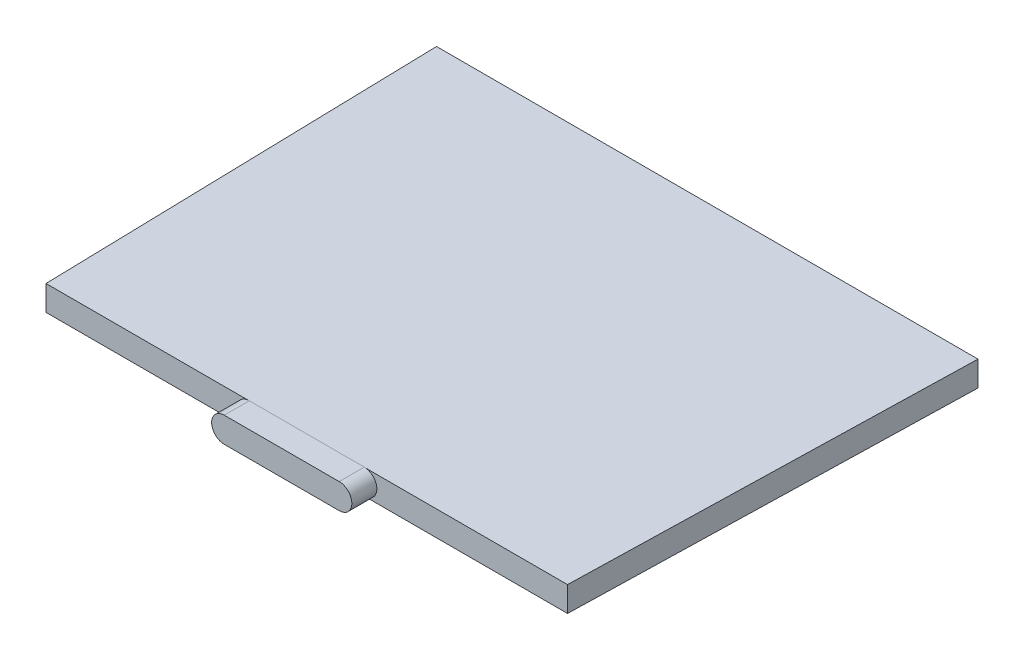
from build123d import *

# Parameters (mm, degrees)
BOSS_EXTRUDE1_DEPTH = 12.5
BOSS_EXTRUDE2_DEPTH = 12.5


with BuildPart() as part:
    # Sketch1 → Boss-Extrude1 (new body)
    with BuildSketch(Plane(origin=(0, 0, 0), x_dir=(1, 0, 0), z_dir=(0, 1, 0))):
        Polygon((135.195, 0), (-135.195, 0), (-130.22, -200), (130.22, -200), align=None)
    extrude(amount=BOSS_EXTRUDE1_DEPTH)

    # Sketch2 → Boss-Extrude2 (add)
    with BuildSketch(Plane.XY.offset(200)):
        with BuildLine():
            Line((-28.7, 12.55), (28.7, 12.55))
            ThreePointArc((28.7, 12.55), (35, 6.25), (28.7, -0.05))
            Line((28.7, -0.05), (-28.7, -0.05))
            ThreePointArc((-28.7, -0.05), (-35, 6.25), (-28.7, 12.55))
        make_face()
    extrude(amount=BOSS_EXTRUDE2_DEPTH)


solid = part.part
